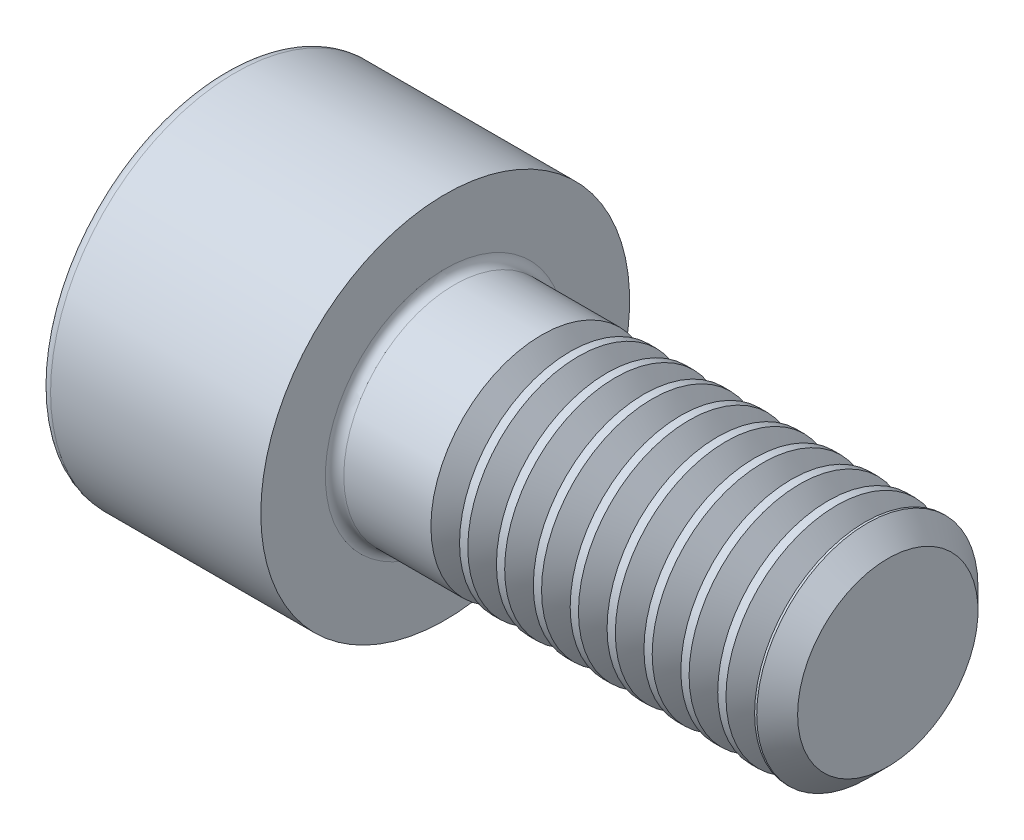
from build123d import *

# Parameters (mm, degrees)
FILLET1_R       = 0.25
FILLET2_R       = 0.3
HEX_2_DEPTH     = 3
THDSCHPAT_COUNT = 9
THDSCHPAT_PITCH = 1


with BuildPart() as part:
    # BodySke → Base-Revolve (revolve)
    with BuildSketch(Plane.XY, mode=Mode.PRIVATE) as base_revolve_sk:
        Polygon((0, 0), (0, 5), (6, 5), (6, 3), (17.4455, 3), (18, 2.4455), (18, 0), align=None)
    revolve(base_revolve_sk.sketch.rotate(Axis((-31.75, 0, 0), (1, 0, 0)), 90), axis=Axis((-31.75, 0, 0), (1, 0, 0)))

    # Fillet1
    fillet1_edges = [part.edges().sort_by_distance(p)[0] for p in [
        (6, 0, -3),
    ]]
    fillet(fillet1_edges, radius=FILLET1_R)

    # Fillet2
    fillet2_edges = [part.edges().sort_by_distance(p)[0] for p in [
        (0, 0, -5),
    ]]
    fillet(fillet2_edges, radius=FILLET2_R)

    # Sketch2 → Hex-PreBroach (revolve, cut)
    with BuildSketch(Plane.XY, mode=Mode.PRIVATE) as hex_prebroach_sk:
        Polygon((0, 2.542), (3, 2.542), (4.467624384, 0), (0, 0), align=None)
    revolve(hex_prebroach_sk.sketch.rotate(Axis((0, 0, 0), (1, 0, 0)), 90), axis=Axis((0, 0, 0), (1, 0, 0)), mode=Mode.SUBTRACT)

    # Sketch3 → Hex 2 (cut)
    with BuildSketch(Plane(origin=(0, 0, 0), x_dir=(0, 0.500000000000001, 0.866025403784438), z_dir=(-1, 0, 0))):
        Polygon((1.467624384, 2.542), (-1.467624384, 2.542), (-2.935248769, 0), (-1.467624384, -2.542), (1.467624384, -2.542), (2.935248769, 0), align=None)
    extrude(amount=-HEX_2_DEPTH, mode=Mode.SUBTRACT)

    # ThdSchSke → ThreadSchematic (revolve, cut)
    with BuildSketch(Plane.XY):
        Polygon((9, -2.4455), (8.61173492, -3), (8.61173492, -3.75), (9.38826508, -3.75), (9.38826508, -3), align=None)
    threadschematic = revolve(axis=Axis((-3.175, 0, 0), (1, 0, 0)), mode=Mode.SUBTRACT)

    # ThdSchPat: ThreadSchematic ×9
    with Locations(*[(i * THDSCHPAT_PITCH, 0, 0) for i in range(1, THDSCHPAT_COUNT)]):
        add(threadschematic, mode=Mode.SUBTRACT)


solid = part.part
